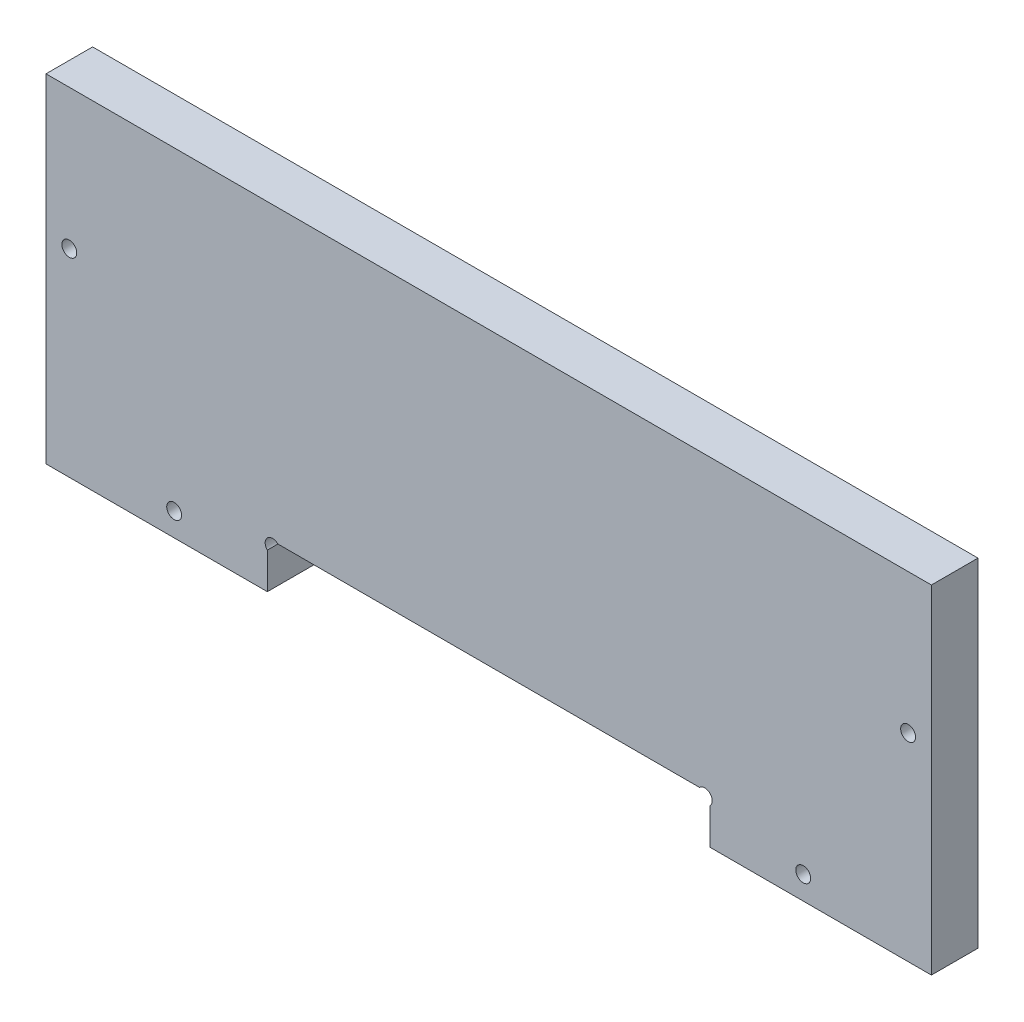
ISO-10303-21;
HEADER;
FILE_DESCRIPTION(('STEP AP214'),'2;1');
FILE_NAME('part.step','',(''),(''),'','','');
FILE_SCHEMA(('AUTOMOTIVE_DESIGN { 1 0 10303 214 1 1 1 1 }'));
ENDSEC;
DATA;
#1=APPLICATION_CONTEXT('core data for automotive mechanical design processes');
#2=APPLICATION_PROTOCOL_DEFINITION('international standard','automotive_design',2000,#1);
#3=PRODUCT_CONTEXT('',#1,'mechanical');
#4=PRODUCT('Part','Part','',(#3));
#5=PRODUCT_RELATED_PRODUCT_CATEGORY('part','',(#4));
#6=PRODUCT_DEFINITION_FORMATION('','',#4);
#7=PRODUCT_DEFINITION_CONTEXT('part definition',#1,'design');
#8=PRODUCT_DEFINITION('design','',#6,#7);
#9=PRODUCT_DEFINITION_SHAPE('','',#8);
#10=(LENGTH_UNIT() NAMED_UNIT(*) SI_UNIT(.MILLI.,.METRE.));
#11=(NAMED_UNIT(*) PLANE_ANGLE_UNIT() SI_UNIT($,.RADIAN.));
#12=(NAMED_UNIT(*) SI_UNIT($,.STERADIAN.) SOLID_ANGLE_UNIT());
#13=UNCERTAINTY_MEASURE_WITH_UNIT(LENGTH_MEASURE(1.E-05),#10,'distance_accuracy_value','');
#14=(GEOMETRIC_REPRESENTATION_CONTEXT(3) GLOBAL_UNCERTAINTY_ASSIGNED_CONTEXT((#13)) GLOBAL_UNIT_ASSIGNED_CONTEXT((#10,
#11,#12)) REPRESENTATION_CONTEXT('',''));
#15=CARTESIAN_POINT('',(0.,0.,0.));
#16=DIRECTION('',(0.,0.,1.));
#17=DIRECTION('',(1.,0.,0.));
#18=AXIS2_PLACEMENT_3D('',#15,#16,#17);
#19=CARTESIAN_POINT('',(-141.368629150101,8.86862915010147,10.));
#20=DIRECTION('',(0.,0.,1.));
#21=DIRECTION('',(1.,0.,0.));
#22=AXIS2_PLACEMENT_3D('',#19,#20,#21);
#23=PLANE('',#22);
#24=CARTESIAN_POINT('',(-5.,42.5,10.));
#25=DIRECTION('',(0.,0.,1.));
#26=DIRECTION('',(-1.,0.,0.));
#27=AXIS2_PLACEMENT_3D('',#24,#25,#26);
#28=CIRCLE('',#27,1.59999999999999);
#29=CARTESIAN_POINT('',(-6.6,42.5,10.));
#30=VERTEX_POINT('',#29);
#31=EDGE_CURVE('E235',#30,#30,#28,.T.);
#32=ORIENTED_EDGE('',*,*,#31,.F.);
#33=EDGE_LOOP('',(#32));
#34=FACE_BOUND('',#33,.T.);
#35=CARTESIAN_POINT('',(-162.5,4.99999999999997,10.));
#36=DIRECTION('',(0.,0.,1.));
#37=DIRECTION('',(1.,0.,0.));
#38=AXIS2_PLACEMENT_3D('',#35,#36,#37);
#39=CIRCLE('',#38,1.59999999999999);
#40=CARTESIAN_POINT('',(-160.9,4.99999999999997,10.));
#41=VERTEX_POINT('',#40);
#42=EDGE_CURVE('E157',#41,#41,#39,.T.);
#43=ORIENTED_EDGE('',*,*,#42,.F.);
#44=EDGE_LOOP('',(#43));
#45=FACE_BOUND('',#44,.T.);
#46=CARTESIAN_POINT('',(-141.368629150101,8.86862915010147,10.));
#47=DIRECTION('',(0.,0.,-1.));
#48=DIRECTION('',(1.,0.,0.));
#49=AXIS2_PLACEMENT_3D('',#46,#47,#48);
#50=CIRCLE('',#49,1.60000000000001);
#51=CARTESIAN_POINT('',(-142.5,7.73725830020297,10.));
#52=VERTEX_POINT('',#51);
#53=CARTESIAN_POINT('',(-140.237258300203,9.99999999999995,10.));
#54=VERTEX_POINT('',#53);
#55=EDGE_CURVE('E175',#52,#54,#50,.T.);
#56=ORIENTED_EDGE('',*,*,#55,.T.);
#57=DIRECTION('',(1.,0.,0.));
#58=VECTOR('',#57,1.);
#59=CARTESIAN_POINT('',(-49.762741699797,9.99999999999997,10.));
#60=LINE('',#59,#58);
#61=CARTESIAN_POINT('',(-49.762741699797,9.99999999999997,10.));
#62=VERTEX_POINT('',#61);
#63=EDGE_CURVE('E103',#54,#62,#60,.T.);
#64=ORIENTED_EDGE('',*,*,#63,.T.);
#65=CARTESIAN_POINT('',(-48.6313708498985,8.86862915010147,10.));
#66=DIRECTION('',(0.,0.,-1.));
#67=DIRECTION('',(-1.,0.,0.));
#68=AXIS2_PLACEMENT_3D('',#65,#66,#67);
#69=CIRCLE('',#68,1.60000000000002);
#70=CARTESIAN_POINT('',(-47.5,7.73725830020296,10.));
#71=VERTEX_POINT('',#70);
#72=EDGE_CURVE('E196',#62,#71,#69,.T.);
#73=ORIENTED_EDGE('',*,*,#72,.T.);
#74=DIRECTION('',(0.,-1.,0.));
#75=VECTOR('',#74,1.);
#76=CARTESIAN_POINT('',(-47.5,7.73725830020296,10.));
#77=LINE('',#76,#75);
#78=CARTESIAN_POINT('',(-47.5,0.,10.));
#79=VERTEX_POINT('',#78);
#80=EDGE_CURVE('E218',#71,#79,#77,.T.);
#81=ORIENTED_EDGE('',*,*,#80,.T.);
#82=DIRECTION('',(1.,0.,0.));
#83=VECTOR('',#82,1.);
#84=CARTESIAN_POINT('',(-47.5,0.,10.));
#85=LINE('',#84,#83);
#86=CARTESIAN_POINT('',(0.,0.,10.));
#87=VERTEX_POINT('',#86);
#88=EDGE_CURVE('E215',#79,#87,#85,.T.);
#89=ORIENTED_EDGE('',*,*,#88,.T.);
#90=DIRECTION('',(0.,1.,0.));
#91=VECTOR('',#90,1.);
#92=CARTESIAN_POINT('',(0.,72.5,10.));
#93=LINE('',#92,#91);
#94=CARTESIAN_POINT('',(0.,72.5,10.));
#95=VERTEX_POINT('',#94);
#96=EDGE_CURVE('E217',#87,#95,#93,.T.);
#97=ORIENTED_EDGE('',*,*,#96,.T.);
#98=DIRECTION('',(-1.,0.,0.));
#99=VECTOR('',#98,1.);
#100=CARTESIAN_POINT('',(0.,72.5,10.));
#101=LINE('',#100,#99);
#102=CARTESIAN_POINT('',(-190.,72.5,10.));
#103=VERTEX_POINT('',#102);
#104=EDGE_CURVE('E132',#95,#103,#101,.T.);
#105=ORIENTED_EDGE('',*,*,#104,.T.);
#106=DIRECTION('',(0.,-1.,0.));
#107=VECTOR('',#106,1.);
#108=CARTESIAN_POINT('',(-190.,72.5,10.));
#109=LINE('',#108,#107);
#110=CARTESIAN_POINT('',(-190.,0.,10.));
#111=VERTEX_POINT('',#110);
#112=EDGE_CURVE('E125',#103,#111,#109,.T.);
#113=ORIENTED_EDGE('',*,*,#112,.T.);
#114=DIRECTION('',(1.,0.,0.));
#115=VECTOR('',#114,1.);
#116=CARTESIAN_POINT('',(-142.5,0.,10.));
#117=LINE('',#116,#115);
#118=CARTESIAN_POINT('',(-142.5,0.,10.));
#119=VERTEX_POINT('',#118);
#120=EDGE_CURVE('E129',#111,#119,#117,.T.);
#121=ORIENTED_EDGE('',*,*,#120,.T.);
#122=DIRECTION('',(0.,1.,0.));
#123=VECTOR('',#122,1.);
#124=CARTESIAN_POINT('',(-142.5,7.73725830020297,10.));
#125=LINE('',#124,#123);
#126=EDGE_CURVE('E56',#119,#52,#125,.T.);
#127=ORIENTED_EDGE('',*,*,#126,.T.);
#128=EDGE_LOOP('',(#56,#64,#73,#81,#89,#97,#105,#113,#121,#127));
#129=FACE_BOUND('',#128,.T.);
#130=CARTESIAN_POINT('',(-185.,42.5,10.));
#131=DIRECTION('',(0.,0.,1.));
#132=DIRECTION('',(1.,0.,0.));
#133=AXIS2_PLACEMENT_3D('',#130,#131,#132);
#134=CIRCLE('',#133,1.59999999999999);
#135=CARTESIAN_POINT('',(-183.4,42.5,10.));
#136=VERTEX_POINT('',#135);
#137=EDGE_CURVE('E229',#136,#136,#134,.T.);
#138=ORIENTED_EDGE('',*,*,#137,.F.);
#139=EDGE_LOOP('',(#138));
#140=FACE_BOUND('',#139,.T.);
#141=CARTESIAN_POINT('',(-27.5,4.99999999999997,10.));
#142=DIRECTION('',(0.,0.,1.));
#143=DIRECTION('',(-1.,0.,0.));
#144=AXIS2_PLACEMENT_3D('',#141,#142,#143);
#145=CIRCLE('',#144,1.59999999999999);
#146=CARTESIAN_POINT('',(-29.1,4.99999999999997,10.));
#147=VERTEX_POINT('',#146);
#148=EDGE_CURVE('E241',#147,#147,#145,.T.);
#149=ORIENTED_EDGE('',*,*,#148,.F.);
#150=EDGE_LOOP('',(#149));
#151=FACE_BOUND('',#150,.T.);
#152=ADVANCED_FACE('F32',(#34,#45,#129,#140,#151),#23,.T.);
#153=CARTESIAN_POINT('',(-141.368629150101,8.86862915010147,0.));
#154=DIRECTION('',(0.,0.,1.));
#155=DIRECTION('',(1.,0.,0.));
#156=AXIS2_PLACEMENT_3D('',#153,#154,#155);
#157=PLANE('',#156);
#158=CARTESIAN_POINT('',(-5.,42.5,0.));
#159=DIRECTION('',(0.,0.,1.));
#160=DIRECTION('',(-1.,0.,0.));
#161=AXIS2_PLACEMENT_3D('',#158,#159,#160);
#162=CIRCLE('',#161,1.59999999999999);
#163=CARTESIAN_POINT('',(-6.6,42.5,0.));
#164=VERTEX_POINT('',#163);
#165=EDGE_CURVE('E238',#164,#164,#162,.T.);
#166=ORIENTED_EDGE('',*,*,#165,.T.);
#167=EDGE_LOOP('',(#166));
#168=FACE_BOUND('',#167,.T.);
#169=CARTESIAN_POINT('',(-162.5,4.99999999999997,0.));
#170=DIRECTION('',(0.,0.,1.));
#171=DIRECTION('',(1.,0.,0.));
#172=AXIS2_PLACEMENT_3D('',#169,#170,#171);
#173=CIRCLE('',#172,1.59999999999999);
#174=CARTESIAN_POINT('',(-160.9,4.99999999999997,0.));
#175=VERTEX_POINT('',#174);
#176=EDGE_CURVE('E226',#175,#175,#173,.T.);
#177=ORIENTED_EDGE('',*,*,#176,.T.);
#178=EDGE_LOOP('',(#177));
#179=FACE_BOUND('',#178,.T.);
#180=CARTESIAN_POINT('',(-104.868629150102,45.8686291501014,0.));
#181=DIRECTION('',(0.,0.,-1.));
#182=DIRECTION('',(-1.,0.,0.));
#183=AXIS2_PLACEMENT_3D('',#180,#181,#182);
#184=CIRCLE('',#183,1.60000000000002);
#185=CARTESIAN_POINT('',(-106.,44.737258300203,0.));
#186=VERTEX_POINT('',#185);
#187=CARTESIAN_POINT('',(-103.737258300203,46.9999999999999,0.));
#188=VERTEX_POINT('',#187);
#189=EDGE_CURVE('E281',#186,#188,#184,.T.);
#190=ORIENTED_EDGE('',*,*,#189,.F.);
#191=DIRECTION('',(0.,1.,0.));
#192=VECTOR('',#191,1.);
#193=CARTESIAN_POINT('',(-106.,44.737258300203,0.));
#194=LINE('',#193,#192);
#195=CARTESIAN_POINT('',(-106.,9.99999999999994,0.));
#196=VERTEX_POINT('',#195);
#197=EDGE_CURVE('E268',#196,#186,#194,.T.);
#198=ORIENTED_EDGE('',*,*,#197,.F.);
#199=DIRECTION('',(1.,0.,0.));
#200=VECTOR('',#199,1.);
#201=CARTESIAN_POINT('',(-49.762741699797,9.99999999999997,0.));
#202=LINE('',#201,#200);
#203=CARTESIAN_POINT('',(-140.237258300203,9.99999999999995,0.));
#204=VERTEX_POINT('',#203);
#205=EDGE_CURVE('E158',#204,#196,#202,.T.);
#206=ORIENTED_EDGE('',*,*,#205,.F.);
#207=CARTESIAN_POINT('',(-141.368629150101,8.86862915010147,0.));
#208=DIRECTION('',(0.,0.,-1.));
#209=DIRECTION('',(1.,0.,0.));
#210=AXIS2_PLACEMENT_3D('',#207,#208,#209);
#211=CIRCLE('',#210,1.60000000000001);
#212=CARTESIAN_POINT('',(-142.5,7.73725830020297,0.));
#213=VERTEX_POINT('',#212);
#214=EDGE_CURVE('E153',#213,#204,#211,.T.);
#215=ORIENTED_EDGE('',*,*,#214,.F.);
#216=DIRECTION('',(0.,1.,0.));
#217=VECTOR('',#216,1.);
#218=CARTESIAN_POINT('',(-142.5,7.73725830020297,0.));
#219=LINE('',#218,#217);
#220=CARTESIAN_POINT('',(-142.5,0.,0.));
#221=VERTEX_POINT('',#220);
#222=EDGE_CURVE('E95',#221,#213,#219,.T.);
#223=ORIENTED_EDGE('',*,*,#222,.F.);
#224=DIRECTION('',(1.,0.,0.));
#225=VECTOR('',#224,1.);
#226=CARTESIAN_POINT('',(-142.5,0.,0.));
#227=LINE('',#226,#225);
#228=CARTESIAN_POINT('',(-190.,0.,0.));
#229=VERTEX_POINT('',#228);
#230=EDGE_CURVE('E172',#229,#221,#227,.T.);
#231=ORIENTED_EDGE('',*,*,#230,.F.);
#232=DIRECTION('',(0.,-1.,0.));
#233=VECTOR('',#232,1.);
#234=CARTESIAN_POINT('',(-190.,72.5,0.));
#235=LINE('',#234,#233);
#236=CARTESIAN_POINT('',(-190.,72.5,0.));
#237=VERTEX_POINT('',#236);
#238=EDGE_CURVE('E141',#237,#229,#235,.T.);
#239=ORIENTED_EDGE('',*,*,#238,.F.);
#240=DIRECTION('',(-1.,0.,0.));
#241=VECTOR('',#240,1.);
#242=CARTESIAN_POINT('',(0.,72.5,0.));
#243=LINE('',#242,#241);
#244=CARTESIAN_POINT('',(0.,72.5,0.));
#245=VERTEX_POINT('',#244);
#246=EDGE_CURVE('E169',#245,#237,#243,.T.);
#247=ORIENTED_EDGE('',*,*,#246,.F.);
#248=DIRECTION('',(0.,1.,0.));
#249=VECTOR('',#248,1.);
#250=CARTESIAN_POINT('',(0.,72.5,0.));
#251=LINE('',#250,#249);
#252=CARTESIAN_POINT('',(0.,0.,0.));
#253=VERTEX_POINT('',#252);
#254=EDGE_CURVE('E167',#253,#245,#251,.T.);
#255=ORIENTED_EDGE('',*,*,#254,.F.);
#256=DIRECTION('',(1.,0.,0.));
#257=VECTOR('',#256,1.);
#258=CARTESIAN_POINT('',(-47.5,0.,0.));
#259=LINE('',#258,#257);
#260=CARTESIAN_POINT('',(-47.5,0.,0.));
#261=VERTEX_POINT('',#260);
#262=EDGE_CURVE('E165',#261,#253,#259,.T.);
#263=ORIENTED_EDGE('',*,*,#262,.F.);
#264=DIRECTION('',(0.,-1.,0.));
#265=VECTOR('',#264,1.);
#266=CARTESIAN_POINT('',(-47.5,7.73725830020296,0.));
#267=LINE('',#266,#265);
#268=CARTESIAN_POINT('',(-47.5,7.73725830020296,0.));
#269=VERTEX_POINT('',#268);
#270=EDGE_CURVE('E163',#269,#261,#267,.T.);
#271=ORIENTED_EDGE('',*,*,#270,.F.);
#272=CARTESIAN_POINT('',(-48.6313708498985,8.86862915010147,0.));
#273=DIRECTION('',(0.,0.,-1.));
#274=DIRECTION('',(-1.,0.,0.));
#275=AXIS2_PLACEMENT_3D('',#272,#273,#274);
#276=CIRCLE('',#275,1.60000000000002);
#277=CARTESIAN_POINT('',(-49.762741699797,9.99999999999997,0.));
#278=VERTEX_POINT('',#277);
#279=EDGE_CURVE('E161',#278,#269,#276,.T.);
#280=ORIENTED_EDGE('',*,*,#279,.F.);
#281=CARTESIAN_POINT('',(-96.,9.99999999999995,0.));
#282=VERTEX_POINT('',#281);
#283=EDGE_CURVE('E156',#282,#278,#202,.T.);
#284=ORIENTED_EDGE('',*,*,#283,.F.);
#285=DIRECTION('',(0.,-1.,0.));
#286=VECTOR('',#285,1.);
#287=CARTESIAN_POINT('',(-96.,44.7372583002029,0.));
#288=LINE('',#287,#286);
#289=CARTESIAN_POINT('',(-96.,44.7372583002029,0.));
#290=VERTEX_POINT('',#289);
#291=EDGE_CURVE('E272',#290,#282,#288,.T.);
#292=ORIENTED_EDGE('',*,*,#291,.F.);
#293=CARTESIAN_POINT('',(-97.1313708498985,45.8686291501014,0.));
#294=DIRECTION('',(0.,0.,-1.));
#295=DIRECTION('',(1.,0.,0.));
#296=AXIS2_PLACEMENT_3D('',#293,#294,#295);
#297=CIRCLE('',#296,1.60000000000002);
#298=CARTESIAN_POINT('',(-98.262741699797,46.9999999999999,0.));
#299=VERTEX_POINT('',#298);
#300=EDGE_CURVE('E275',#299,#290,#297,.T.);
#301=ORIENTED_EDGE('',*,*,#300,.F.);
#302=DIRECTION('',(1.,0.,0.));
#303=VECTOR('',#302,1.);
#304=CARTESIAN_POINT('',(-98.262741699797,46.9999999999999,0.));
#305=LINE('',#304,#303);
#306=EDGE_CURVE('E278',#188,#299,#305,.T.);
#307=ORIENTED_EDGE('',*,*,#306,.F.);
#308=EDGE_LOOP('',(#190,#198,#206,#215,#223,#231,#239,#247,#255,#263,#271,#280,#284,#292,#301,#307));
#309=FACE_BOUND('',#308,.T.);
#310=CARTESIAN_POINT('',(-185.,42.5,0.));
#311=DIRECTION('',(0.,0.,1.));
#312=DIRECTION('',(1.,0.,0.));
#313=AXIS2_PLACEMENT_3D('',#310,#311,#312);
#314=CIRCLE('',#313,1.59999999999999);
#315=CARTESIAN_POINT('',(-183.4,42.5,0.));
#316=VERTEX_POINT('',#315);
#317=EDGE_CURVE('E232',#316,#316,#314,.T.);
#318=ORIENTED_EDGE('',*,*,#317,.T.);
#319=EDGE_LOOP('',(#318));
#320=FACE_BOUND('',#319,.T.);
#321=CARTESIAN_POINT('',(-27.5,4.99999999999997,0.));
#322=DIRECTION('',(0.,0.,1.));
#323=DIRECTION('',(-1.,0.,0.));
#324=AXIS2_PLACEMENT_3D('',#321,#322,#323);
#325=CIRCLE('',#324,1.59999999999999);
#326=CARTESIAN_POINT('',(-29.1,4.99999999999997,0.));
#327=VERTEX_POINT('',#326);
#328=EDGE_CURVE('E244',#327,#327,#325,.T.);
#329=ORIENTED_EDGE('',*,*,#328,.T.);
#330=EDGE_LOOP('',(#329));
#331=FACE_BOUND('',#330,.T.);
#332=ADVANCED_FACE('F201',(#168,#179,#309,#320,#331),#157,.F.);
#333=CARTESIAN_POINT('',(-141.368629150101,8.86862915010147,10.));
#334=DIRECTION('',(0.,0.,-1.));
#335=DIRECTION('',(-1.,0.,0.));
#336=AXIS2_PLACEMENT_3D('',#333,#334,#335);
#337=CYLINDRICAL_SURFACE('',#336,1.60000000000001);
#338=ORIENTED_EDGE('',*,*,#214,.T.);
#339=DIRECTION('',(0.,0.,-1.));
#340=VECTOR('',#339,1.);
#341=CARTESIAN_POINT('',(-140.237258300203,9.99999999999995,10.));
#342=LINE('',#341,#340);
#343=EDGE_CURVE('E11',#54,#204,#342,.T.);
#344=ORIENTED_EDGE('',*,*,#343,.F.);
#345=ORIENTED_EDGE('',*,*,#55,.F.);
#346=DIRECTION('',(0.,0.,-1.));
#347=VECTOR('',#346,1.);
#348=CARTESIAN_POINT('',(-142.5,7.73725830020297,10.));
#349=LINE('',#348,#347);
#350=EDGE_CURVE('E149',#52,#213,#349,.T.);
#351=ORIENTED_EDGE('',*,*,#350,.T.);
#352=EDGE_LOOP('',(#338,#344,#345,#351));
#353=FACE_BOUND('',#352,.T.);
#354=ADVANCED_FACE('F34',(#353),#337,.F.);
#355=CARTESIAN_POINT('',(-49.762741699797,9.99999999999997,10.));
#356=DIRECTION('',(0.,1.,0.));
#357=DIRECTION('',(-1.,0.,0.));
#358=AXIS2_PLACEMENT_3D('',#355,#356,#357);
#359=PLANE('',#358);
#360=ORIENTED_EDGE('',*,*,#205,.T.);
#361=DIRECTION('',(0.,0.,-1.));
#362=VECTOR('',#361,1.);
#363=CARTESIAN_POINT('',(-106.,9.99999999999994,5.));
#364=LINE('',#363,#362);
#365=CARTESIAN_POINT('',(-106.,9.99999999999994,5.));
#366=VERTEX_POINT('',#365);
#367=EDGE_CURVE('E263',#366,#196,#364,.T.);
#368=ORIENTED_EDGE('',*,*,#367,.F.);
#369=DIRECTION('',(-1.,0.,0.));
#370=VECTOR('',#369,1.);
#371=CARTESIAN_POINT('',(-106.,9.99999999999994,5.));
#372=LINE('',#371,#370);
#373=CARTESIAN_POINT('',(-96.,9.99999999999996,5.));
#374=VERTEX_POINT('',#373);
#375=EDGE_CURVE('E286',#374,#366,#372,.T.);
#376=ORIENTED_EDGE('',*,*,#375,.F.);
#377=DIRECTION('',(0.,0.,-1.));
#378=VECTOR('',#377,1.);
#379=CARTESIAN_POINT('',(-96.,9.99999999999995,5.));
#380=LINE('',#379,#378);
#381=EDGE_CURVE('E260',#374,#282,#380,.T.);
#382=ORIENTED_EDGE('',*,*,#381,.T.);
#383=ORIENTED_EDGE('',*,*,#283,.T.);
#384=DIRECTION('',(0.,0.,-1.));
#385=VECTOR('',#384,1.);
#386=CARTESIAN_POINT('',(-49.762741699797,9.99999999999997,10.));
#387=LINE('',#386,#385);
#388=EDGE_CURVE('E40',#62,#278,#387,.T.);
#389=ORIENTED_EDGE('',*,*,#388,.F.);
#390=ORIENTED_EDGE('',*,*,#63,.F.);
#391=ORIENTED_EDGE('',*,*,#343,.T.);
#392=EDGE_LOOP('',(#360,#368,#376,#382,#383,#389,#390,#391));
#393=FACE_BOUND('',#392,.T.);
#394=ADVANCED_FACE('F326',(#393),#359,.F.);
#395=CARTESIAN_POINT('',(-48.6313708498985,8.86862915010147,10.));
#396=DIRECTION('',(0.,0.,-1.));
#397=DIRECTION('',(-1.,0.,0.));
#398=AXIS2_PLACEMENT_3D('',#395,#396,#397);
#399=CYLINDRICAL_SURFACE('',#398,1.60000000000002);
#400=ORIENTED_EDGE('',*,*,#279,.T.);
#401=DIRECTION('',(0.,0.,-1.));
#402=VECTOR('',#401,1.);
#403=CARTESIAN_POINT('',(-47.5,7.73725830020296,10.));
#404=LINE('',#403,#402);
#405=EDGE_CURVE('E188',#71,#269,#404,.T.);
#406=ORIENTED_EDGE('',*,*,#405,.F.);
#407=ORIENTED_EDGE('',*,*,#72,.F.);
#408=ORIENTED_EDGE('',*,*,#388,.T.);
#409=EDGE_LOOP('',(#400,#406,#407,#408));
#410=FACE_BOUND('',#409,.T.);
#411=ADVANCED_FACE('F194',(#410),#399,.F.);
#412=CARTESIAN_POINT('',(-47.5,7.73725830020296,10.));
#413=DIRECTION('',(1.,0.,0.));
#414=DIRECTION('',(0.,0.,-1.));
#415=AXIS2_PLACEMENT_3D('',#412,#413,#414);
#416=PLANE('',#415);
#417=ORIENTED_EDGE('',*,*,#270,.T.);
#418=DIRECTION('',(0.,0.,-1.));
#419=VECTOR('',#418,1.);
#420=CARTESIAN_POINT('',(-47.5,0.,10.));
#421=LINE('',#420,#419);
#422=EDGE_CURVE('E185',#79,#261,#421,.T.);
#423=ORIENTED_EDGE('',*,*,#422,.F.);
#424=ORIENTED_EDGE('',*,*,#80,.F.);
#425=ORIENTED_EDGE('',*,*,#405,.T.);
#426=EDGE_LOOP('',(#417,#423,#424,#425));
#427=FACE_BOUND('',#426,.T.);
#428=ADVANCED_FACE('F209',(#427),#416,.F.);
#429=CARTESIAN_POINT('',(-47.5,0.,10.));
#430=DIRECTION('',(0.,1.,0.));
#431=DIRECTION('',(0.,0.,1.));
#432=AXIS2_PLACEMENT_3D('',#429,#430,#431);
#433=PLANE('',#432);
#434=ORIENTED_EDGE('',*,*,#262,.T.);
#435=DIRECTION('',(0.,0.,-1.));
#436=VECTOR('',#435,1.);
#437=CARTESIAN_POINT('',(0.,0.,10.));
#438=LINE('',#437,#436);
#439=EDGE_CURVE('E182',#87,#253,#438,.T.);
#440=ORIENTED_EDGE('',*,*,#439,.F.);
#441=ORIENTED_EDGE('',*,*,#88,.F.);
#442=ORIENTED_EDGE('',*,*,#422,.T.);
#443=EDGE_LOOP('',(#434,#440,#441,#442));
#444=FACE_BOUND('',#443,.T.);
#445=ADVANCED_FACE('F213',(#444),#433,.F.);
#446=CARTESIAN_POINT('',(0.,72.5,10.));
#447=DIRECTION('',(-1.,0.,0.));
#448=DIRECTION('',(0.,0.,1.));
#449=AXIS2_PLACEMENT_3D('',#446,#447,#448);
#450=PLANE('',#449);
#451=ORIENTED_EDGE('',*,*,#254,.T.);
#452=DIRECTION('',(0.,0.,-1.));
#453=VECTOR('',#452,1.);
#454=CARTESIAN_POINT('',(0.,72.5,10.));
#455=LINE('',#454,#453);
#456=EDGE_CURVE('E179',#95,#245,#455,.T.);
#457=ORIENTED_EDGE('',*,*,#456,.F.);
#458=ORIENTED_EDGE('',*,*,#96,.F.);
#459=ORIENTED_EDGE('',*,*,#439,.T.);
#460=EDGE_LOOP('',(#451,#457,#458,#459));
#461=FACE_BOUND('',#460,.T.);
#462=ADVANCED_FACE('F450',(#461),#450,.F.);
#463=CARTESIAN_POINT('',(0.,72.5,10.));
#464=DIRECTION('',(0.,-1.,0.));
#465=DIRECTION('',(0.,0.,-1.));
#466=AXIS2_PLACEMENT_3D('',#463,#464,#465);
#467=PLANE('',#466);
#468=ORIENTED_EDGE('',*,*,#246,.T.);
#469=DIRECTION('',(0.,0.,-1.));
#470=VECTOR('',#469,1.);
#471=CARTESIAN_POINT('',(-190.,72.5,10.));
#472=LINE('',#471,#470);
#473=EDGE_CURVE('E144',#103,#237,#472,.T.);
#474=ORIENTED_EDGE('',*,*,#473,.F.);
#475=ORIENTED_EDGE('',*,*,#104,.F.);
#476=ORIENTED_EDGE('',*,*,#456,.T.);
#477=EDGE_LOOP('',(#468,#474,#475,#476));
#478=FACE_BOUND('',#477,.T.);
#479=ADVANCED_FACE('F441',(#478),#467,.F.);
#480=CARTESIAN_POINT('',(-190.,72.5,10.));
#481=DIRECTION('',(1.,0.,0.));
#482=DIRECTION('',(0.,0.,-1.));
#483=AXIS2_PLACEMENT_3D('',#480,#481,#482);
#484=PLANE('',#483);
#485=ORIENTED_EDGE('',*,*,#238,.T.);
#486=DIRECTION('',(0.,0.,-1.));
#487=VECTOR('',#486,1.);
#488=CARTESIAN_POINT('',(-190.,0.,10.));
#489=LINE('',#488,#487);
#490=EDGE_CURVE('E138',#111,#229,#489,.T.);
#491=ORIENTED_EDGE('',*,*,#490,.F.);
#492=ORIENTED_EDGE('',*,*,#112,.F.);
#493=ORIENTED_EDGE('',*,*,#473,.T.);
#494=EDGE_LOOP('',(#485,#491,#492,#493));
#495=FACE_BOUND('',#494,.T.);
#496=ADVANCED_FACE('F139',(#495),#484,.F.);
#497=CARTESIAN_POINT('',(-142.5,0.,10.));
#498=DIRECTION('',(0.,1.,0.));
#499=DIRECTION('',(0.,0.,1.));
#500=AXIS2_PLACEMENT_3D('',#497,#498,#499);
#501=PLANE('',#500);
#502=ORIENTED_EDGE('',*,*,#230,.T.);
#503=DIRECTION('',(0.,0.,-1.));
#504=VECTOR('',#503,1.);
#505=CARTESIAN_POINT('',(-142.5,0.,10.));
#506=LINE('',#505,#504);
#507=EDGE_CURVE('E145',#119,#221,#506,.T.);
#508=ORIENTED_EDGE('',*,*,#507,.F.);
#509=ORIENTED_EDGE('',*,*,#120,.F.);
#510=ORIENTED_EDGE('',*,*,#490,.T.);
#511=EDGE_LOOP('',(#502,#508,#509,#510));
#512=FACE_BOUND('',#511,.T.);
#513=ADVANCED_FACE('F147',(#512),#501,.F.);
#514=CARTESIAN_POINT('',(-142.5,7.73725830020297,10.));
#515=DIRECTION('',(-1.,0.,0.));
#516=DIRECTION('',(0.,0.,1.));
#517=AXIS2_PLACEMENT_3D('',#514,#515,#516);
#518=PLANE('',#517);
#519=ORIENTED_EDGE('',*,*,#222,.T.);
#520=ORIENTED_EDGE('',*,*,#350,.F.);
#521=ORIENTED_EDGE('',*,*,#126,.F.);
#522=ORIENTED_EDGE('',*,*,#507,.T.);
#523=EDGE_LOOP('',(#519,#520,#521,#522));
#524=FACE_BOUND('',#523,.T.);
#525=ADVANCED_FACE('F331',(#524),#518,.F.);
#526=CARTESIAN_POINT('',(-162.5,4.99999999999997,10.));
#527=DIRECTION('',(0.,0.,-1.));
#528=DIRECTION('',(-1.,0.,0.));
#529=AXIS2_PLACEMENT_3D('',#526,#527,#528);
#530=CYLINDRICAL_SURFACE('',#529,1.59999999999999);
#531=ORIENTED_EDGE('',*,*,#42,.T.);
#532=EDGE_LOOP('',(#531));
#533=FACE_BOUND('',#532,.T.);
#534=ORIENTED_EDGE('',*,*,#176,.F.);
#535=EDGE_LOOP('',(#534));
#536=FACE_BOUND('',#535,.T.);
#537=ADVANCED_FACE('F333',(#533,#536),#530,.F.);
#538=CARTESIAN_POINT('',(-185.,42.5,10.));
#539=DIRECTION('',(0.,0.,-1.));
#540=DIRECTION('',(-1.,0.,0.));
#541=AXIS2_PLACEMENT_3D('',#538,#539,#540);
#542=CYLINDRICAL_SURFACE('',#541,1.59999999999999);
#543=ORIENTED_EDGE('',*,*,#137,.T.);
#544=EDGE_LOOP('',(#543));
#545=FACE_BOUND('',#544,.T.);
#546=ORIENTED_EDGE('',*,*,#317,.F.);
#547=EDGE_LOOP('',(#546));
#548=FACE_BOUND('',#547,.T.);
#549=ADVANCED_FACE('F339',(#545,#548),#542,.F.);
#550=CARTESIAN_POINT('',(-5.,42.5,10.));
#551=DIRECTION('',(0.,0.,-1.));
#552=DIRECTION('',(-1.,0.,0.));
#553=AXIS2_PLACEMENT_3D('',#550,#551,#552);
#554=CYLINDRICAL_SURFACE('',#553,1.59999999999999);
#555=ORIENTED_EDGE('',*,*,#31,.T.);
#556=EDGE_LOOP('',(#555));
#557=FACE_BOUND('',#556,.T.);
#558=ORIENTED_EDGE('',*,*,#165,.F.);
#559=EDGE_LOOP('',(#558));
#560=FACE_BOUND('',#559,.T.);
#561=ADVANCED_FACE('F356',(#557,#560),#554,.F.);
#562=CARTESIAN_POINT('',(-27.5,4.99999999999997,10.));
#563=DIRECTION('',(0.,0.,-1.));
#564=DIRECTION('',(-1.,0.,0.));
#565=AXIS2_PLACEMENT_3D('',#562,#563,#564);
#566=CYLINDRICAL_SURFACE('',#565,1.59999999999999);
#567=ORIENTED_EDGE('',*,*,#148,.T.);
#568=EDGE_LOOP('',(#567));
#569=FACE_BOUND('',#568,.T.);
#570=ORIENTED_EDGE('',*,*,#328,.F.);
#571=EDGE_LOOP('',(#570));
#572=FACE_BOUND('',#571,.T.);
#573=ADVANCED_FACE('F360',(#569,#572),#566,.F.);
#574=CARTESIAN_POINT('',(-104.868629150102,45.8686291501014,5.));
#575=DIRECTION('',(0.,0.,-1.));
#576=DIRECTION('',(-1.,0.,0.));
#577=AXIS2_PLACEMENT_3D('',#574,#575,#576);
#578=CYLINDRICAL_SURFACE('',#577,1.60000000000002);
#579=ORIENTED_EDGE('',*,*,#189,.T.);
#580=DIRECTION('',(0.,0.,-1.));
#581=VECTOR('',#580,1.);
#582=CARTESIAN_POINT('',(-103.737258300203,46.9999999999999,5.));
#583=LINE('',#582,#581);
#584=CARTESIAN_POINT('',(-103.737258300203,46.9999999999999,5.));
#585=VERTEX_POINT('',#584);
#586=EDGE_CURVE('E250',#585,#188,#583,.T.);
#587=ORIENTED_EDGE('',*,*,#586,.F.);
#588=CARTESIAN_POINT('',(-104.868629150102,45.8686291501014,5.));
#589=DIRECTION('',(0.,0.,-1.));
#590=DIRECTION('',(-1.,0.,0.));
#591=AXIS2_PLACEMENT_3D('',#588,#589,#590);
#592=CIRCLE('',#591,1.60000000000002);
#593=CARTESIAN_POINT('',(-106.,44.737258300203,5.));
#594=VERTEX_POINT('',#593);
#595=EDGE_CURVE('E271',#594,#585,#592,.T.);
#596=ORIENTED_EDGE('',*,*,#595,.F.);
#597=DIRECTION('',(0.,0.,-1.));
#598=VECTOR('',#597,1.);
#599=CARTESIAN_POINT('',(-106.,44.737258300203,5.));
#600=LINE('',#599,#598);
#601=EDGE_CURVE('E247',#594,#186,#600,.T.);
#602=ORIENTED_EDGE('',*,*,#601,.T.);
#603=EDGE_LOOP('',(#579,#587,#596,#602));
#604=FACE_BOUND('',#603,.T.);
#605=ADVANCED_FACE('F304',(#604),#578,.F.);
#606=CARTESIAN_POINT('',(-106.,44.737258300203,5.));
#607=DIRECTION('',(-1.,0.,0.));
#608=DIRECTION('',(0.,-1.,0.));
#609=AXIS2_PLACEMENT_3D('',#606,#607,#608);
#610=PLANE('',#609);
#611=ORIENTED_EDGE('',*,*,#197,.T.);
#612=ORIENTED_EDGE('',*,*,#601,.F.);
#613=DIRECTION('',(0.,1.,0.));
#614=VECTOR('',#613,1.);
#615=CARTESIAN_POINT('',(-106.,44.737258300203,5.));
#616=LINE('',#615,#614);
#617=EDGE_CURVE('E254',#366,#594,#616,.T.);
#618=ORIENTED_EDGE('',*,*,#617,.F.);
#619=ORIENTED_EDGE('',*,*,#367,.T.);
#620=EDGE_LOOP('',(#611,#612,#618,#619));
#621=FACE_BOUND('',#620,.T.);
#622=ADVANCED_FACE('F322',(#621),#610,.F.);
#623=CARTESIAN_POINT('',(-96.,44.7372583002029,5.));
#624=DIRECTION('',(1.,0.,0.));
#625=DIRECTION('',(0.,0.,-1.));
#626=AXIS2_PLACEMENT_3D('',#623,#624,#625);
#627=PLANE('',#626);
#628=ORIENTED_EDGE('',*,*,#291,.T.);
#629=ORIENTED_EDGE('',*,*,#381,.F.);
#630=DIRECTION('',(0.,-1.,0.));
#631=VECTOR('',#630,1.);
#632=CARTESIAN_POINT('',(-96.,44.7372583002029,5.));
#633=LINE('',#632,#631);
#634=CARTESIAN_POINT('',(-96.,44.7372583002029,5.));
#635=VERTEX_POINT('',#634);
#636=EDGE_CURVE('E47',#635,#374,#633,.T.);
#637=ORIENTED_EDGE('',*,*,#636,.F.);
#638=DIRECTION('',(0.,0.,-1.));
#639=VECTOR('',#638,1.);
#640=CARTESIAN_POINT('',(-96.,44.7372583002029,5.));
#641=LINE('',#640,#639);
#642=EDGE_CURVE('E257',#635,#290,#641,.T.);
#643=ORIENTED_EDGE('',*,*,#642,.T.);
#644=EDGE_LOOP('',(#628,#629,#637,#643));
#645=FACE_BOUND('',#644,.T.);
#646=ADVANCED_FACE('F374',(#645),#627,.F.);
#647=CARTESIAN_POINT('',(-97.1313708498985,45.8686291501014,5.));
#648=DIRECTION('',(0.,0.,-1.));
#649=DIRECTION('',(-1.,0.,0.));
#650=AXIS2_PLACEMENT_3D('',#647,#648,#649);
#651=CYLINDRICAL_SURFACE('',#650,1.60000000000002);
#652=ORIENTED_EDGE('',*,*,#300,.T.);
#653=ORIENTED_EDGE('',*,*,#642,.F.);
#654=CARTESIAN_POINT('',(-97.1313708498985,45.8686291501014,5.));
#655=DIRECTION('',(0.,0.,-1.));
#656=DIRECTION('',(1.,0.,0.));
#657=AXIS2_PLACEMENT_3D('',#654,#655,#656);
#658=CIRCLE('',#657,1.60000000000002);
#659=CARTESIAN_POINT('',(-98.262741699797,46.9999999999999,5.));
#660=VERTEX_POINT('',#659);
#661=EDGE_CURVE('E289',#660,#635,#658,.T.);
#662=ORIENTED_EDGE('',*,*,#661,.F.);
#663=DIRECTION('',(0.,0.,-1.));
#664=VECTOR('',#663,1.);
#665=CARTESIAN_POINT('',(-98.262741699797,46.9999999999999,5.));
#666=LINE('',#665,#664);
#667=EDGE_CURVE('E253',#660,#299,#666,.T.);
#668=ORIENTED_EDGE('',*,*,#667,.T.);
#669=EDGE_LOOP('',(#652,#653,#662,#668));
#670=FACE_BOUND('',#669,.T.);
#671=ADVANCED_FACE('F370',(#670),#651,.F.);
#672=CARTESIAN_POINT('',(-98.262741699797,46.9999999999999,5.));
#673=DIRECTION('',(0.,1.,0.));
#674=DIRECTION('',(0.,0.,1.));
#675=AXIS2_PLACEMENT_3D('',#672,#673,#674);
#676=PLANE('',#675);
#677=ORIENTED_EDGE('',*,*,#306,.T.);
#678=ORIENTED_EDGE('',*,*,#667,.F.);
#679=DIRECTION('',(1.,0.,0.));
#680=VECTOR('',#679,1.);
#681=CARTESIAN_POINT('',(-98.262741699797,46.9999999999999,5.));
#682=LINE('',#681,#680);
#683=EDGE_CURVE('E291',#585,#660,#682,.T.);
#684=ORIENTED_EDGE('',*,*,#683,.F.);
#685=ORIENTED_EDGE('',*,*,#586,.T.);
#686=EDGE_LOOP('',(#677,#678,#684,#685));
#687=FACE_BOUND('',#686,.T.);
#688=ADVANCED_FACE('F367',(#687),#676,.F.);
#689=CARTESIAN_POINT('',(-104.868629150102,45.8686291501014,5.));
#690=DIRECTION('',(0.,0.,-1.));
#691=DIRECTION('',(-1.,0.,0.));
#692=AXIS2_PLACEMENT_3D('',#689,#690,#691);
#693=PLANE('',#692);
#694=ORIENTED_EDGE('',*,*,#595,.T.);
#695=ORIENTED_EDGE('',*,*,#683,.T.);
#696=ORIENTED_EDGE('',*,*,#661,.T.);
#697=ORIENTED_EDGE('',*,*,#636,.T.);
#698=ORIENTED_EDGE('',*,*,#375,.T.);
#699=ORIENTED_EDGE('',*,*,#617,.T.);
#700=EDGE_LOOP('',(#694,#695,#696,#697,#698,#699));
#701=FACE_BOUND('',#700,.T.);
#702=ADVANCED_FACE('F297',(#701),#693,.T.);
#703=CLOSED_SHELL('',(#152,#332,#354,#394,#411,#428,#445,#462,#479,#496,#513,#525,#537,#549,
#561,#573,#605,#622,#646,#671,#688,#702));
#704=MANIFOLD_SOLID_BREP('B2',#703);
#705=ADVANCED_BREP_SHAPE_REPRESENTATION('',(#18,#704),#14);
#706=SHAPE_DEFINITION_REPRESENTATION(#9,#705);
ENDSEC;
END-ISO-10303-21;
